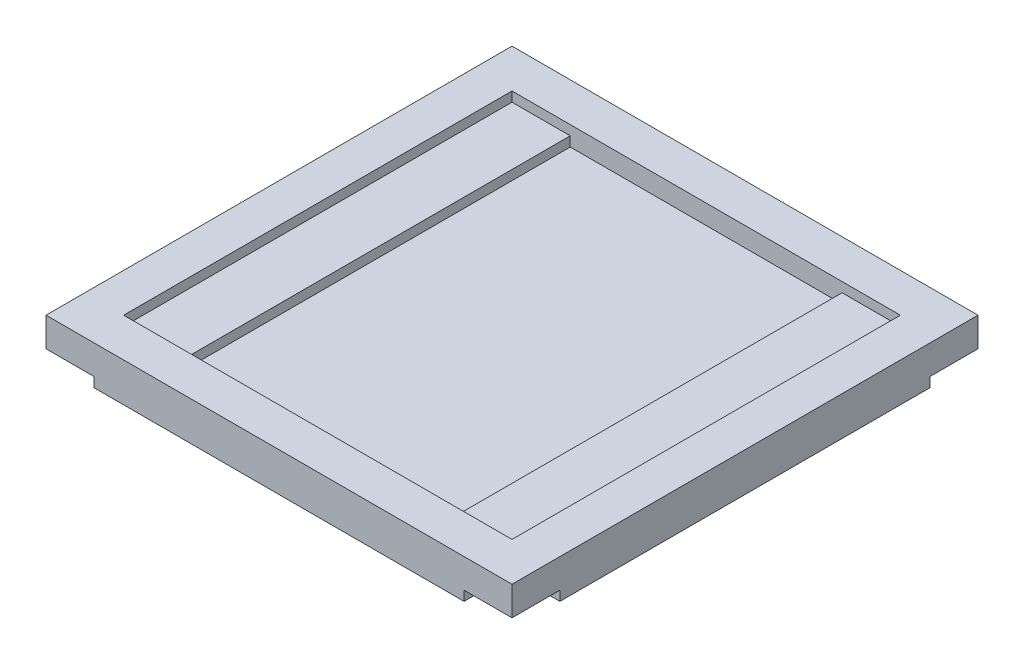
from build123d import *

# Parameters (mm, degrees)
SKETCH1_W           = 120
SKETCH1_H           = 120
BOSS_EXTRUDE1_DEPTH = 10
SKETCH3_W           = 12.34
SKETCH3_H           = 12.34
CUT_EXTRUDE1_DEPTH  = 2.5
SKETCH4_W           = 100
SKETCH4_H           = 100
CUT_EXTRUDE2_DEPTH  = 2.5
SKETCH5_W           = 70
SKETCH5_H           = 100
CUT_EXTRUDE3_DEPTH  = 2.5


with BuildPart() as part:
    # Sketch1 → Boss-Extrude1 (new body)
    with BuildSketch(Plane(origin=(0, 0, 0), x_dir=(1, 0, 0), z_dir=(0, 1, 0))):
        with Locations((50, 50)):
            Rectangle(SKETCH1_W, SKETCH1_H)
    extrude(amount=BOSS_EXTRUDE1_DEPTH)

    # Sketch3 → Cut-Extrude1 (cut)
    with BuildSketch(Plane.XZ):
        with Locations((103.83, 3.83)):
            Rectangle(SKETCH3_W, SKETCH3_H)
        with Locations((-3.83, 3.83)):
            Rectangle(SKETCH3_W, SKETCH3_H)
        with Locations((103.83, -103.83)):
            Rectangle(SKETCH3_W, SKETCH3_H)
        with Locations((-3.83, -103.83)):
            Rectangle(SKETCH3_W, SKETCH3_H)
    extrude(amount=-CUT_EXTRUDE1_DEPTH, mode=Mode.SUBTRACT)

    # Sketch4 → Cut-Extrude2 (cut)
    with BuildSketch(Plane(origin=(0, 10, 0), x_dir=(1, 0, 0), z_dir=(0, 1, 0))):
        with Locations((50, 50)):
            Rectangle(SKETCH4_W, SKETCH4_H)
    extrude(amount=-CUT_EXTRUDE2_DEPTH, mode=Mode.SUBTRACT)

    # Sketch5 → Cut-Extrude3 (cut)
    with BuildSketch(Plane(origin=(0, 7.5, 0), x_dir=(1, 0, 0), z_dir=(0, 1, 0))):
        with Locations((50, 50)):
            Rectangle(SKETCH5_W, SKETCH5_H)
    extrude(amount=-CUT_EXTRUDE3_DEPTH, mode=Mode.SUBTRACT)


solid = part.part
